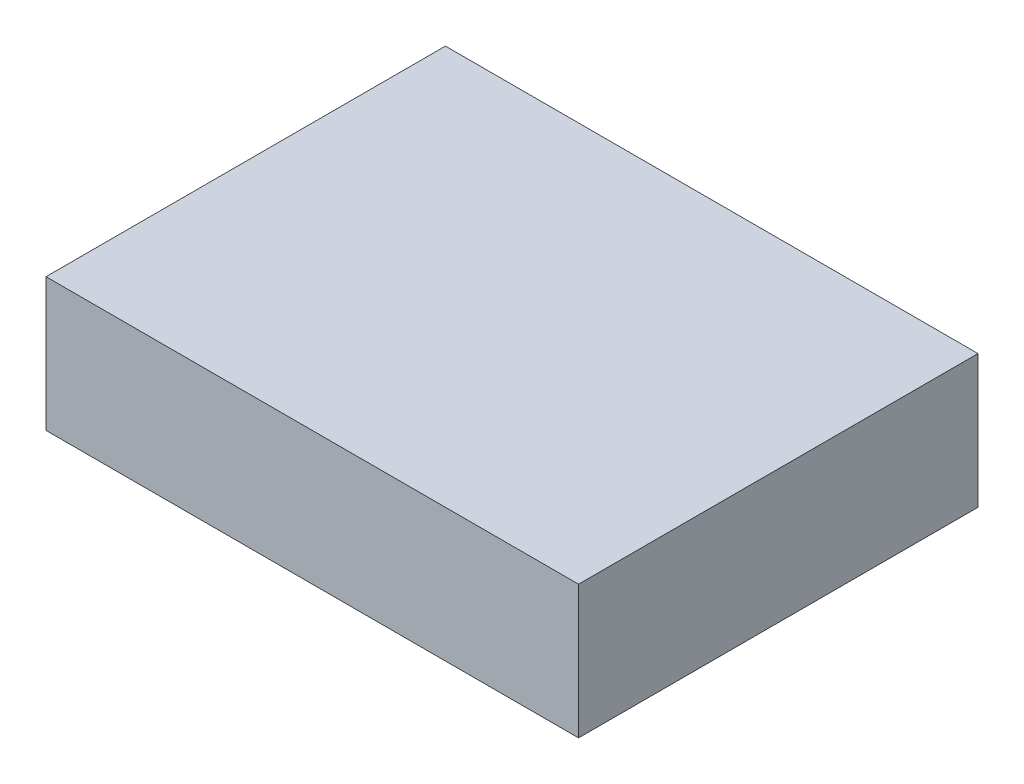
ISO-10303-21;
HEADER;
FILE_DESCRIPTION(('STEP AP214'),'2;1');
FILE_NAME('part.step','',(''),(''),'','','');
FILE_SCHEMA(('AUTOMOTIVE_DESIGN { 1 0 10303 214 1 1 1 1 }'));
ENDSEC;
DATA;
#1=APPLICATION_CONTEXT('core data for automotive mechanical design processes');
#2=APPLICATION_PROTOCOL_DEFINITION('international standard','automotive_design',2000,#1);
#3=PRODUCT_CONTEXT('',#1,'mechanical');
#4=PRODUCT('Part','Part','',(#3));
#5=PRODUCT_RELATED_PRODUCT_CATEGORY('part','',(#4));
#6=PRODUCT_DEFINITION_FORMATION('','',#4);
#7=PRODUCT_DEFINITION_CONTEXT('part definition',#1,'design');
#8=PRODUCT_DEFINITION('design','',#6,#7);
#9=PRODUCT_DEFINITION_SHAPE('','',#8);
#10=(LENGTH_UNIT() NAMED_UNIT(*) SI_UNIT(.MILLI.,.METRE.));
#11=(NAMED_UNIT(*) PLANE_ANGLE_UNIT() SI_UNIT($,.RADIAN.));
#12=(NAMED_UNIT(*) SI_UNIT($,.STERADIAN.) SOLID_ANGLE_UNIT());
#13=UNCERTAINTY_MEASURE_WITH_UNIT(LENGTH_MEASURE(1.E-05),#10,'distance_accuracy_value','');
#14=(GEOMETRIC_REPRESENTATION_CONTEXT(3) GLOBAL_UNCERTAINTY_ASSIGNED_CONTEXT((#13)) GLOBAL_UNIT_ASSIGNED_CONTEXT((#10,
#11,#12)) REPRESENTATION_CONTEXT('',''));
#15=CARTESIAN_POINT('',(0.,0.,0.));
#16=DIRECTION('',(0.,0.,1.));
#17=DIRECTION('',(1.,0.,0.));
#18=AXIS2_PLACEMENT_3D('',#15,#16,#17);
#19=CARTESIAN_POINT('',(25.4,-6.35,38.1));
#20=DIRECTION('',(-1.,0.,0.));
#21=DIRECTION('',(0.,0.,1.));
#22=AXIS2_PLACEMENT_3D('',#19,#20,#21);
#23=PLANE('',#22);
#24=DIRECTION('',(0.,1.,0.));
#25=VECTOR('',#24,1.);
#26=CARTESIAN_POINT('',(25.4,-6.35,0.));
#27=LINE('',#26,#25);
#28=CARTESIAN_POINT('',(25.4,-6.35,0.));
#29=VERTEX_POINT('',#28);
#30=CARTESIAN_POINT('',(25.4,6.35,0.));
#31=VERTEX_POINT('',#30);
#32=EDGE_CURVE('E113',#29,#31,#27,.T.);
#33=ORIENTED_EDGE('',*,*,#32,.T.);
#34=DIRECTION('',(0.,0.,-1.));
#35=VECTOR('',#34,1.);
#36=CARTESIAN_POINT('',(25.4,6.35,38.1));
#37=LINE('',#36,#35);
#38=CARTESIAN_POINT('',(25.4,6.35,38.1));
#39=VERTEX_POINT('',#38);
#40=EDGE_CURVE('E11',#39,#31,#37,.T.);
#41=ORIENTED_EDGE('',*,*,#40,.F.);
#42=DIRECTION('',(0.,1.,0.));
#43=VECTOR('',#42,1.);
#44=CARTESIAN_POINT('',(25.4,-6.35,38.1));
#45=LINE('',#44,#43);
#46=CARTESIAN_POINT('',(25.4,-6.35,38.1));
#47=VERTEX_POINT('',#46);
#48=EDGE_CURVE('E97',#47,#39,#45,.T.);
#49=ORIENTED_EDGE('',*,*,#48,.F.);
#50=DIRECTION('',(0.,0.,-1.));
#51=VECTOR('',#50,1.);
#52=CARTESIAN_POINT('',(25.4,-6.35,38.1));
#53=LINE('',#52,#51);
#54=EDGE_CURVE('E109',#47,#29,#53,.T.);
#55=ORIENTED_EDGE('',*,*,#54,.T.);
#56=EDGE_LOOP('',(#33,#41,#49,#55));
#57=FACE_BOUND('',#56,.T.);
#58=ADVANCED_FACE('F45',(#57),#23,.F.);
#59=CARTESIAN_POINT('',(-25.4,6.35,38.1));
#60=DIRECTION('',(0.,-1.,0.));
#61=DIRECTION('',(0.,0.,-1.));
#62=AXIS2_PLACEMENT_3D('',#59,#60,#61);
#63=PLANE('',#62);
#64=DIRECTION('',(-1.,0.,0.));
#65=VECTOR('',#64,1.);
#66=CARTESIAN_POINT('',(-25.4,6.35,0.));
#67=LINE('',#66,#65);
#68=CARTESIAN_POINT('',(-25.4,6.35,0.));
#69=VERTEX_POINT('',#68);
#70=EDGE_CURVE('E102',#31,#69,#67,.T.);
#71=ORIENTED_EDGE('',*,*,#70,.T.);
#72=DIRECTION('',(0.,0.,-1.));
#73=VECTOR('',#72,1.);
#74=CARTESIAN_POINT('',(-25.4,6.35,38.1));
#75=LINE('',#74,#73);
#76=CARTESIAN_POINT('',(-25.4,6.35,38.1));
#77=VERTEX_POINT('',#76);
#78=EDGE_CURVE('E54',#77,#69,#75,.T.);
#79=ORIENTED_EDGE('',*,*,#78,.F.);
#80=DIRECTION('',(-1.,0.,0.));
#81=VECTOR('',#80,1.);
#82=CARTESIAN_POINT('',(-25.4,6.35,38.1));
#83=LINE('',#82,#81);
#84=EDGE_CURVE('E92',#39,#77,#83,.T.);
#85=ORIENTED_EDGE('',*,*,#84,.F.);
#86=ORIENTED_EDGE('',*,*,#40,.T.);
#87=EDGE_LOOP('',(#71,#79,#85,#86));
#88=FACE_BOUND('',#87,.T.);
#89=ADVANCED_FACE('F101',(#88),#63,.F.);
#90=CARTESIAN_POINT('',(-25.4,-6.35,38.1));
#91=DIRECTION('',(1.,0.,0.));
#92=DIRECTION('',(0.,0.,-1.));
#93=AXIS2_PLACEMENT_3D('',#90,#91,#92);
#94=PLANE('',#93);
#95=DIRECTION('',(0.,-1.,0.));
#96=VECTOR('',#95,1.);
#97=CARTESIAN_POINT('',(-25.4,-6.35,0.));
#98=LINE('',#97,#96);
#99=CARTESIAN_POINT('',(-25.4,-6.35,0.));
#100=VERTEX_POINT('',#99);
#101=EDGE_CURVE('E79',#69,#100,#98,.T.);
#102=ORIENTED_EDGE('',*,*,#101,.T.);
#103=DIRECTION('',(0.,0.,-1.));
#104=VECTOR('',#103,1.);
#105=CARTESIAN_POINT('',(-25.4,-6.35,38.1));
#106=LINE('',#105,#104);
#107=CARTESIAN_POINT('',(-25.4,-6.35,38.1));
#108=VERTEX_POINT('',#107);
#109=EDGE_CURVE('E104',#108,#100,#106,.T.);
#110=ORIENTED_EDGE('',*,*,#109,.F.);
#111=DIRECTION('',(0.,-1.,0.));
#112=VECTOR('',#111,1.);
#113=CARTESIAN_POINT('',(-25.4,-6.35,38.1));
#114=LINE('',#113,#112);
#115=EDGE_CURVE('E95',#77,#108,#114,.T.);
#116=ORIENTED_EDGE('',*,*,#115,.F.);
#117=ORIENTED_EDGE('',*,*,#78,.T.);
#118=EDGE_LOOP('',(#102,#110,#116,#117));
#119=FACE_BOUND('',#118,.T.);
#120=ADVANCED_FACE('F105',(#119),#94,.F.);
#121=CARTESIAN_POINT('',(-25.4,-6.35,38.1));
#122=DIRECTION('',(0.,1.,0.));
#123=DIRECTION('',(0.,0.,1.));
#124=AXIS2_PLACEMENT_3D('',#121,#122,#123);
#125=PLANE('',#124);
#126=DIRECTION('',(1.,0.,0.));
#127=VECTOR('',#126,1.);
#128=CARTESIAN_POINT('',(-25.4,-6.35,0.));
#129=LINE('',#128,#127);
#130=EDGE_CURVE('E85',#100,#29,#129,.T.);
#131=ORIENTED_EDGE('',*,*,#130,.T.);
#132=ORIENTED_EDGE('',*,*,#54,.F.);
#133=DIRECTION('',(1.,0.,0.));
#134=VECTOR('',#133,1.);
#135=CARTESIAN_POINT('',(-25.4,-6.35,38.1));
#136=LINE('',#135,#134);
#137=EDGE_CURVE('E62',#108,#47,#136,.T.);
#138=ORIENTED_EDGE('',*,*,#137,.F.);
#139=ORIENTED_EDGE('',*,*,#109,.T.);
#140=EDGE_LOOP('',(#131,#132,#138,#139));
#141=FACE_BOUND('',#140,.T.);
#142=ADVANCED_FACE('F126',(#141),#125,.F.);
#143=CARTESIAN_POINT('',(0.,0.,38.1));
#144=DIRECTION('',(0.,0.,-1.));
#145=DIRECTION('',(-1.,0.,0.));
#146=AXIS2_PLACEMENT_3D('',#143,#144,#145);
#147=PLANE('',#146);
#148=ORIENTED_EDGE('',*,*,#48,.T.);
#149=ORIENTED_EDGE('',*,*,#84,.T.);
#150=ORIENTED_EDGE('',*,*,#115,.T.);
#151=ORIENTED_EDGE('',*,*,#137,.T.);
#152=EDGE_LOOP('',(#148,#149,#150,#151));
#153=FACE_BOUND('',#152,.T.);
#154=ADVANCED_FACE('F93',(#153),#147,.F.);
#155=CARTESIAN_POINT('',(0.,0.,0.));
#156=DIRECTION('',(0.,0.,-1.));
#157=DIRECTION('',(-1.,0.,0.));
#158=AXIS2_PLACEMENT_3D('',#155,#156,#157);
#159=PLANE('',#158);
#160=ORIENTED_EDGE('',*,*,#32,.F.);
#161=ORIENTED_EDGE('',*,*,#130,.F.);
#162=ORIENTED_EDGE('',*,*,#101,.F.);
#163=ORIENTED_EDGE('',*,*,#70,.F.);
#164=EDGE_LOOP('',(#160,#161,#162,#163));
#165=FACE_BOUND('',#164,.T.);
#166=ADVANCED_FACE('F129',(#165),#159,.T.);
#167=CLOSED_SHELL('',(#58,#89,#120,#142,#154,#166));
#168=MANIFOLD_SOLID_BREP('B2',#167);
#169=ADVANCED_BREP_SHAPE_REPRESENTATION('',(#18,#168),#14);
#170=SHAPE_DEFINITION_REPRESENTATION(#9,#169);
ENDSEC;
END-ISO-10303-21;
